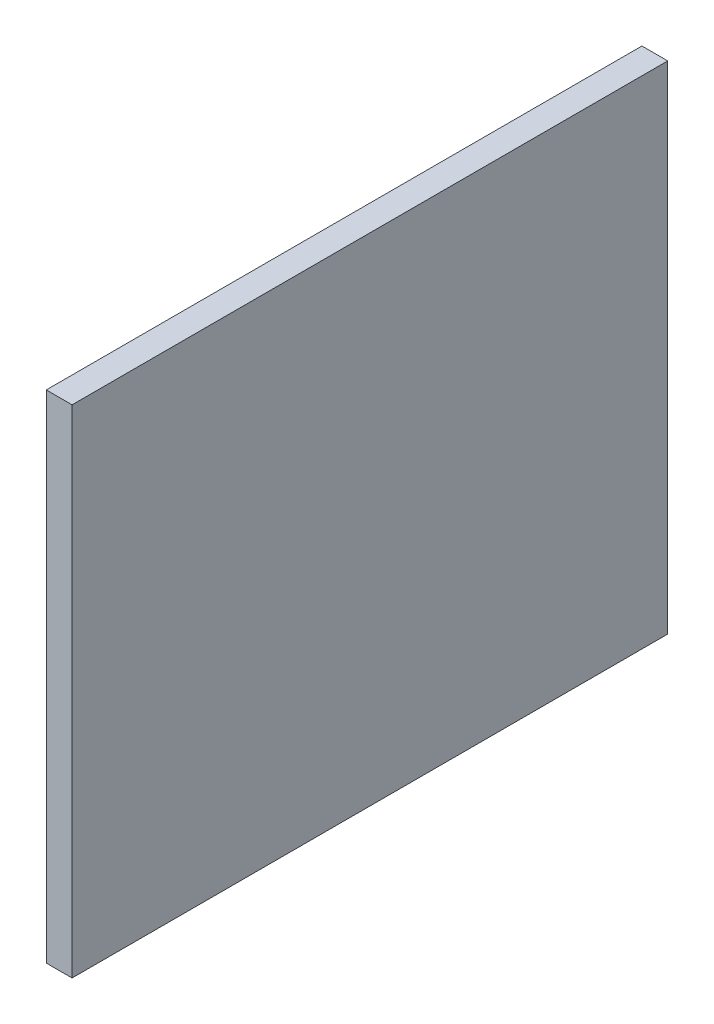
ISO-10303-21;
HEADER;
FILE_DESCRIPTION(('STEP AP214'),'2;1');
FILE_NAME('part.step','',(''),(''),'','','');
FILE_SCHEMA(('AUTOMOTIVE_DESIGN { 1 0 10303 214 1 1 1 1 }'));
ENDSEC;
DATA;
#1=APPLICATION_CONTEXT('core data for automotive mechanical design processes');
#2=APPLICATION_PROTOCOL_DEFINITION('international standard','automotive_design',2000,#1);
#3=PRODUCT_CONTEXT('',#1,'mechanical');
#4=PRODUCT('Part','Part','',(#3));
#5=PRODUCT_RELATED_PRODUCT_CATEGORY('part','',(#4));
#6=PRODUCT_DEFINITION_FORMATION('','',#4);
#7=PRODUCT_DEFINITION_CONTEXT('part definition',#1,'design');
#8=PRODUCT_DEFINITION('design','',#6,#7);
#9=PRODUCT_DEFINITION_SHAPE('','',#8);
#10=(LENGTH_UNIT() NAMED_UNIT(*) SI_UNIT(.MILLI.,.METRE.));
#11=(NAMED_UNIT(*) PLANE_ANGLE_UNIT() SI_UNIT($,.RADIAN.));
#12=(NAMED_UNIT(*) SI_UNIT($,.STERADIAN.) SOLID_ANGLE_UNIT());
#13=UNCERTAINTY_MEASURE_WITH_UNIT(LENGTH_MEASURE(1.E-05),#10,'distance_accuracy_value','');
#14=(GEOMETRIC_REPRESENTATION_CONTEXT(3) GLOBAL_UNCERTAINTY_ASSIGNED_CONTEXT((#13)) GLOBAL_UNIT_ASSIGNED_CONTEXT((#10,
#11,#12)) REPRESENTATION_CONTEXT('',''));
#15=CARTESIAN_POINT('',(0.,0.,0.));
#16=DIRECTION('',(0.,0.,1.));
#17=DIRECTION('',(1.,0.,0.));
#18=AXIS2_PLACEMENT_3D('',#15,#16,#17);
#19=CARTESIAN_POINT('',(3.302,31.75,0.));
#20=DIRECTION('',(0.,0.,1.));
#21=DIRECTION('',(1.,0.,0.));
#22=AXIS2_PLACEMENT_3D('',#19,#20,#21);
#23=PLANE('',#22);
#24=DIRECTION('',(0.,1.,0.));
#25=VECTOR('',#24,1.);
#26=CARTESIAN_POINT('',(0.,31.75,0.));
#27=LINE('',#26,#25);
#28=CARTESIAN_POINT('',(0.,-31.75,0.));
#29=VERTEX_POINT('',#28);
#30=CARTESIAN_POINT('',(0.,31.75,0.));
#31=VERTEX_POINT('',#30);
#32=EDGE_CURVE('E96',#29,#31,#27,.T.);
#33=ORIENTED_EDGE('',*,*,#32,.T.);
#34=DIRECTION('',(-1.,0.,0.));
#35=VECTOR('',#34,1.);
#36=CARTESIAN_POINT('',(3.302,31.75,0.));
#37=LINE('',#36,#35);
#38=CARTESIAN_POINT('',(3.302,31.75,0.));
#39=VERTEX_POINT('',#38);
#40=EDGE_CURVE('E11',#39,#31,#37,.T.);
#41=ORIENTED_EDGE('',*,*,#40,.F.);
#42=DIRECTION('',(0.,1.,0.));
#43=VECTOR('',#42,1.);
#44=CARTESIAN_POINT('',(3.302,31.75,0.));
#45=LINE('',#44,#43);
#46=CARTESIAN_POINT('',(3.302,-31.75,0.));
#47=VERTEX_POINT('',#46);
#48=EDGE_CURVE('E84',#47,#39,#45,.T.);
#49=ORIENTED_EDGE('',*,*,#48,.F.);
#50=DIRECTION('',(-1.,0.,0.));
#51=VECTOR('',#50,1.);
#52=CARTESIAN_POINT('',(3.302,-31.75,0.));
#53=LINE('',#52,#51);
#54=EDGE_CURVE('E92',#47,#29,#53,.T.);
#55=ORIENTED_EDGE('',*,*,#54,.T.);
#56=EDGE_LOOP('',(#33,#41,#49,#55));
#57=FACE_BOUND('',#56,.T.);
#58=ADVANCED_FACE('F33',(#57),#23,.F.);
#59=CARTESIAN_POINT('',(3.302,31.75,0.));
#60=DIRECTION('',(0.,-1.,0.));
#61=DIRECTION('',(0.,0.,-1.));
#62=AXIS2_PLACEMENT_3D('',#59,#60,#61);
#63=PLANE('',#62);
#64=DIRECTION('',(0.,0.,1.));
#65=VECTOR('',#64,1.);
#66=CARTESIAN_POINT('',(0.,31.75,0.));
#67=LINE('',#66,#65);
#68=CARTESIAN_POINT('',(0.,31.75,76.2));
#69=VERTEX_POINT('',#68);
#70=EDGE_CURVE('E88',#31,#69,#67,.T.);
#71=ORIENTED_EDGE('',*,*,#70,.T.);
#72=DIRECTION('',(-1.,0.,0.));
#73=VECTOR('',#72,1.);
#74=CARTESIAN_POINT('',(3.302,31.75,76.2));
#75=LINE('',#74,#73);
#76=CARTESIAN_POINT('',(3.302,31.75,76.2));
#77=VERTEX_POINT('',#76);
#78=EDGE_CURVE('E41',#77,#69,#75,.T.);
#79=ORIENTED_EDGE('',*,*,#78,.F.);
#80=DIRECTION('',(0.,0.,1.));
#81=VECTOR('',#80,1.);
#82=CARTESIAN_POINT('',(3.302,31.75,0.));
#83=LINE('',#82,#81);
#84=EDGE_CURVE('E79',#39,#77,#83,.T.);
#85=ORIENTED_EDGE('',*,*,#84,.F.);
#86=ORIENTED_EDGE('',*,*,#40,.T.);
#87=EDGE_LOOP('',(#71,#79,#85,#86));
#88=FACE_BOUND('',#87,.T.);
#89=ADVANCED_FACE('F87',(#88),#63,.F.);
#90=CARTESIAN_POINT('',(3.302,31.75,76.2));
#91=DIRECTION('',(0.,0.,-1.));
#92=DIRECTION('',(0.,1.,0.));
#93=AXIS2_PLACEMENT_3D('',#90,#91,#92);
#94=PLANE('',#93);
#95=DIRECTION('',(0.,-1.,0.));
#96=VECTOR('',#95,1.);
#97=CARTESIAN_POINT('',(0.,31.75,76.2));
#98=LINE('',#97,#96);
#99=CARTESIAN_POINT('',(0.,-31.75,76.2));
#100=VERTEX_POINT('',#99);
#101=EDGE_CURVE('E66',#69,#100,#98,.T.);
#102=ORIENTED_EDGE('',*,*,#101,.T.);
#103=DIRECTION('',(-1.,0.,0.));
#104=VECTOR('',#103,1.);
#105=CARTESIAN_POINT('',(3.302,-31.75,76.2));
#106=LINE('',#105,#104);
#107=CARTESIAN_POINT('',(3.302,-31.75,76.2));
#108=VERTEX_POINT('',#107);
#109=EDGE_CURVE('E89',#108,#100,#106,.T.);
#110=ORIENTED_EDGE('',*,*,#109,.F.);
#111=DIRECTION('',(0.,-1.,0.));
#112=VECTOR('',#111,1.);
#113=CARTESIAN_POINT('',(3.302,31.75,76.2));
#114=LINE('',#113,#112);
#115=EDGE_CURVE('E82',#77,#108,#114,.T.);
#116=ORIENTED_EDGE('',*,*,#115,.F.);
#117=ORIENTED_EDGE('',*,*,#78,.T.);
#118=EDGE_LOOP('',(#102,#110,#116,#117));
#119=FACE_BOUND('',#118,.T.);
#120=ADVANCED_FACE('F90',(#119),#94,.F.);
#121=CARTESIAN_POINT('',(3.302,-31.75,0.));
#122=DIRECTION('',(0.,1.,0.));
#123=DIRECTION('',(0.,0.,1.));
#124=AXIS2_PLACEMENT_3D('',#121,#122,#123);
#125=PLANE('',#124);
#126=DIRECTION('',(0.,0.,-1.));
#127=VECTOR('',#126,1.);
#128=CARTESIAN_POINT('',(0.,-31.75,0.));
#129=LINE('',#128,#127);
#130=EDGE_CURVE('E72',#100,#29,#129,.T.);
#131=ORIENTED_EDGE('',*,*,#130,.T.);
#132=ORIENTED_EDGE('',*,*,#54,.F.);
#133=DIRECTION('',(0.,0.,-1.));
#134=VECTOR('',#133,1.);
#135=CARTESIAN_POINT('',(3.302,-31.75,0.));
#136=LINE('',#135,#134);
#137=EDGE_CURVE('E49',#108,#47,#136,.T.);
#138=ORIENTED_EDGE('',*,*,#137,.F.);
#139=ORIENTED_EDGE('',*,*,#109,.T.);
#140=EDGE_LOOP('',(#131,#132,#138,#139));
#141=FACE_BOUND('',#140,.T.);
#142=ADVANCED_FACE('F103',(#141),#125,.F.);
#143=CARTESIAN_POINT('',(3.302,0.,0.));
#144=DIRECTION('',(-1.,0.,0.));
#145=DIRECTION('',(0.,0.,1.));
#146=AXIS2_PLACEMENT_3D('',#143,#144,#145);
#147=PLANE('',#146);
#148=ORIENTED_EDGE('',*,*,#48,.T.);
#149=ORIENTED_EDGE('',*,*,#84,.T.);
#150=ORIENTED_EDGE('',*,*,#115,.T.);
#151=ORIENTED_EDGE('',*,*,#137,.T.);
#152=EDGE_LOOP('',(#148,#149,#150,#151));
#153=FACE_BOUND('',#152,.T.);
#154=ADVANCED_FACE('F80',(#153),#147,.F.);
#155=CARTESIAN_POINT('',(0.,0.,0.));
#156=DIRECTION('',(-1.,0.,0.));
#157=DIRECTION('',(0.,0.,1.));
#158=AXIS2_PLACEMENT_3D('',#155,#156,#157);
#159=PLANE('',#158);
#160=ORIENTED_EDGE('',*,*,#32,.F.);
#161=ORIENTED_EDGE('',*,*,#130,.F.);
#162=ORIENTED_EDGE('',*,*,#101,.F.);
#163=ORIENTED_EDGE('',*,*,#70,.F.);
#164=EDGE_LOOP('',(#160,#161,#162,#163));
#165=FACE_BOUND('',#164,.T.);
#166=ADVANCED_FACE('F106',(#165),#159,.T.);
#167=CLOSED_SHELL('',(#58,#89,#120,#142,#154,#166));
#168=MANIFOLD_SOLID_BREP('B2',#167);
#169=ADVANCED_BREP_SHAPE_REPRESENTATION('',(#18,#168),#14);
#170=SHAPE_DEFINITION_REPRESENTATION(#9,#169);
ENDSEC;
END-ISO-10303-21;
